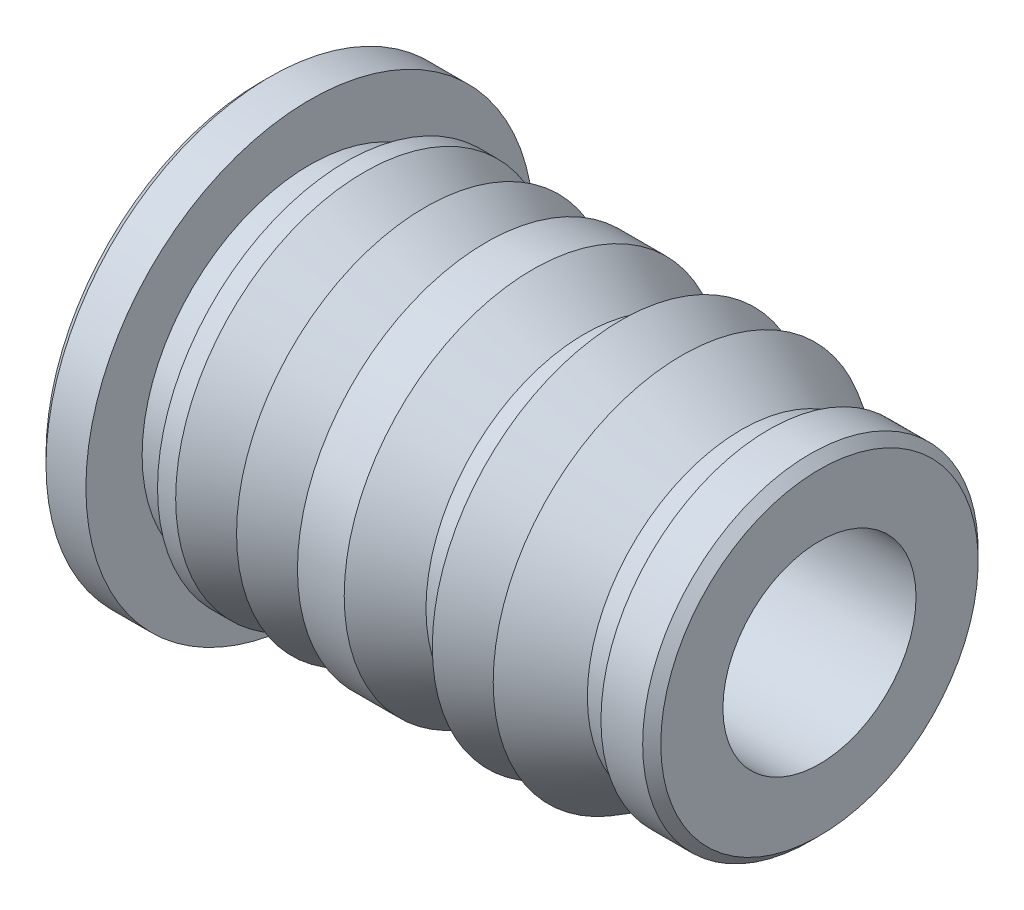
ISO-10303-21;
HEADER;
FILE_DESCRIPTION(('STEP AP214'),'2;1');
FILE_NAME('part.step','',(''),(''),'','','');
FILE_SCHEMA(('AUTOMOTIVE_DESIGN { 1 0 10303 214 1 1 1 1 }'));
ENDSEC;
DATA;
#1=APPLICATION_CONTEXT('core data for automotive mechanical design processes');
#2=APPLICATION_PROTOCOL_DEFINITION('international standard','automotive_design',2000,#1);
#3=PRODUCT_CONTEXT('',#1,'mechanical');
#4=PRODUCT('Part','Part','',(#3));
#5=PRODUCT_RELATED_PRODUCT_CATEGORY('part','',(#4));
#6=PRODUCT_DEFINITION_FORMATION('','',#4);
#7=PRODUCT_DEFINITION_CONTEXT('part definition',#1,'design');
#8=PRODUCT_DEFINITION('design','',#6,#7);
#9=PRODUCT_DEFINITION_SHAPE('','',#8);
#10=(LENGTH_UNIT() NAMED_UNIT(*) SI_UNIT(.MILLI.,.METRE.));
#11=(NAMED_UNIT(*) PLANE_ANGLE_UNIT() SI_UNIT($,.RADIAN.));
#12=(NAMED_UNIT(*) SI_UNIT($,.STERADIAN.) SOLID_ANGLE_UNIT());
#13=UNCERTAINTY_MEASURE_WITH_UNIT(LENGTH_MEASURE(1.E-05),#10,'distance_accuracy_value','');
#14=(GEOMETRIC_REPRESENTATION_CONTEXT(3) GLOBAL_UNCERTAINTY_ASSIGNED_CONTEXT((#13)) GLOBAL_UNIT_ASSIGNED_CONTEXT((#10,
#11,#12)) REPRESENTATION_CONTEXT('',''));
#15=CARTESIAN_POINT('',(0.,0.,0.));
#16=DIRECTION('',(0.,0.,1.));
#17=DIRECTION('',(1.,0.,0.));
#18=AXIS2_PLACEMENT_3D('',#15,#16,#17);
#19=CARTESIAN_POINT('',(0.,0.,0.));
#20=DIRECTION('',(-1.,0.,0.));
#21=DIRECTION('',(0.,0.,1.));
#22=AXIS2_PLACEMENT_3D('',#19,#20,#21);
#23=CONICAL_SURFACE('',#22,1.905,0.785398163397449);
#24=CARTESIAN_POINT('',(0.55245,0.,0.));
#25=DIRECTION('',(-1.,0.,0.));
#26=DIRECTION('',(0.,0.,1.));
#27=AXIS2_PLACEMENT_3D('',#24,#25,#26);
#28=CIRCLE('',#27,1.35255);
#29=CARTESIAN_POINT('',(0.55245,0.,1.35255));
#30=VERTEX_POINT('',#29);
#31=EDGE_CURVE('E11',#30,#30,#28,.T.);
#32=ORIENTED_EDGE('',*,*,#31,.F.);
#33=EDGE_LOOP('',(#32));
#34=FACE_BOUND('',#33,.T.);
#35=CARTESIAN_POINT('',(0.,0.,0.));
#36=DIRECTION('',(-1.,0.,0.));
#37=DIRECTION('',(0.,0.,1.));
#38=AXIS2_PLACEMENT_3D('',#35,#36,#37);
#39=CIRCLE('',#38,1.905);
#40=CARTESIAN_POINT('',(0.,0.,1.905));
#41=VERTEX_POINT('',#40);
#42=EDGE_CURVE('E26',#41,#41,#39,.T.);
#43=ORIENTED_EDGE('',*,*,#42,.T.);
#44=EDGE_LOOP('',(#43));
#45=FACE_BOUND('',#44,.T.);
#46=ADVANCED_FACE('F17',(#34,#45),#23,.F.);
#47=CARTESIAN_POINT('',(0.,0.,0.));
#48=DIRECTION('',(-1.,0.,0.));
#49=DIRECTION('',(0.,0.,1.));
#50=AXIS2_PLACEMENT_3D('',#47,#48,#49);
#51=CYLINDRICAL_SURFACE('',#50,1.35255);
#52=CARTESIAN_POINT('',(7.8232,0.,0.));
#53=DIRECTION('',(-1.,0.,0.));
#54=DIRECTION('',(0.,0.,1.));
#55=AXIS2_PLACEMENT_3D('',#52,#53,#54);
#56=CIRCLE('',#55,1.35255);
#57=CARTESIAN_POINT('',(7.8232,0.,1.35255));
#58=VERTEX_POINT('',#57);
#59=EDGE_CURVE('E197',#58,#58,#56,.T.);
#60=ORIENTED_EDGE('',*,*,#59,.F.);
#61=EDGE_LOOP('',(#60));
#62=FACE_BOUND('',#61,.T.);
#63=ORIENTED_EDGE('',*,*,#31,.T.);
#64=EDGE_LOOP('',(#63));
#65=FACE_BOUND('',#64,.T.);
#66=ADVANCED_FACE('F244',(#62,#65),#51,.F.);
#67=CARTESIAN_POINT('',(0.,0.,0.));
#68=DIRECTION('',(1.,0.,0.));
#69=DIRECTION('',(0.,1.,0.));
#70=AXIS2_PLACEMENT_3D('',#67,#68,#69);
#71=PLANE('',#70);
#72=ORIENTED_EDGE('',*,*,#42,.F.);
#73=EDGE_LOOP('',(#72));
#74=FACE_BOUND('',#73,.T.);
#75=CARTESIAN_POINT('',(0.,0.,0.));
#76=DIRECTION('',(-1.,0.,0.));
#77=DIRECTION('',(0.,0.,1.));
#78=AXIS2_PLACEMENT_3D('',#75,#76,#77);
#79=CIRCLE('',#78,3.0099);
#80=CARTESIAN_POINT('',(0.,0.,3.0099));
#81=VERTEX_POINT('',#80);
#82=EDGE_CURVE('E120',#81,#81,#79,.T.);
#83=ORIENTED_EDGE('',*,*,#82,.T.);
#84=EDGE_LOOP('',(#83));
#85=FACE_BOUND('',#84,.T.);
#86=ADVANCED_FACE('F121',(#74,#85),#71,.F.);
#87=CARTESIAN_POINT('',(0.127,0.,0.));
#88=DIRECTION('',(1.,0.,0.));
#89=DIRECTION('',(0.,0.,-1.));
#90=AXIS2_PLACEMENT_3D('',#87,#88,#89);
#91=CONICAL_SURFACE('',#90,3.1369,0.78539816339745);
#92=ORIENTED_EDGE('',*,*,#82,.F.);
#93=EDGE_LOOP('',(#92));
#94=FACE_BOUND('',#93,.T.);
#95=CARTESIAN_POINT('',(0.127,0.,0.));
#96=DIRECTION('',(-1.,0.,0.));
#97=DIRECTION('',(0.,0.,1.));
#98=AXIS2_PLACEMENT_3D('',#95,#96,#97);
#99=CIRCLE('',#98,3.1369);
#100=CARTESIAN_POINT('',(0.127,0.,3.1369));
#101=VERTEX_POINT('',#100);
#102=EDGE_CURVE('E124',#101,#101,#99,.T.);
#103=ORIENTED_EDGE('',*,*,#102,.T.);
#104=EDGE_LOOP('',(#103));
#105=FACE_BOUND('',#104,.T.);
#106=ADVANCED_FACE('F255',(#94,#105),#91,.T.);
#107=CARTESIAN_POINT('',(1.41129348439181E-12,0.,0.));
#108=DIRECTION('',(-1.,0.,0.));
#109=DIRECTION('',(0.,0.,1.));
#110=AXIS2_PLACEMENT_3D('',#107,#108,#109);
#111=CYLINDRICAL_SURFACE('',#110,3.1369);
#112=ORIENTED_EDGE('',*,*,#102,.F.);
#113=EDGE_LOOP('',(#112));
#114=FACE_BOUND('',#113,.T.);
#115=CARTESIAN_POINT('',(0.6858,0.,0.));
#116=DIRECTION('',(-1.,0.,0.));
#117=DIRECTION('',(0.,0.,1.));
#118=AXIS2_PLACEMENT_3D('',#115,#116,#117);
#119=CIRCLE('',#118,3.1369);
#120=CARTESIAN_POINT('',(0.6858,0.,3.1369));
#121=VERTEX_POINT('',#120);
#122=EDGE_CURVE('E130',#121,#121,#119,.T.);
#123=ORIENTED_EDGE('',*,*,#122,.T.);
#124=EDGE_LOOP('',(#123));
#125=FACE_BOUND('',#124,.T.);
#126=ADVANCED_FACE('F261',(#114,#125),#111,.T.);
#127=CARTESIAN_POINT('',(0.6858,3.1369,0.));
#128=DIRECTION('',(-1.,0.,0.));
#129=DIRECTION('',(0.,0.,1.));
#130=AXIS2_PLACEMENT_3D('',#127,#128,#129);
#131=PLANE('',#130);
#132=CARTESIAN_POINT('',(0.6858,0.,0.));
#133=DIRECTION('',(-1.,0.,0.));
#134=DIRECTION('',(0.,0.,1.));
#135=AXIS2_PLACEMENT_3D('',#132,#133,#134);
#136=CIRCLE('',#135,2.3495);
#137=CARTESIAN_POINT('',(0.6858,0.,2.3495));
#138=VERTEX_POINT('',#137);
#139=EDGE_CURVE('E135',#138,#138,#136,.T.);
#140=ORIENTED_EDGE('',*,*,#139,.T.);
#141=EDGE_LOOP('',(#140));
#142=FACE_BOUND('',#141,.T.);
#143=ORIENTED_EDGE('',*,*,#122,.F.);
#144=EDGE_LOOP('',(#143));
#145=FACE_BOUND('',#144,.T.);
#146=ADVANCED_FACE('F484',(#142,#145),#131,.F.);
#147=CARTESIAN_POINT('',(1.41129348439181E-12,0.,0.));
#148=DIRECTION('',(-1.,0.,0.));
#149=DIRECTION('',(0.,0.,1.));
#150=AXIS2_PLACEMENT_3D('',#147,#148,#149);
#151=CYLINDRICAL_SURFACE('',#150,2.3495);
#152=ORIENTED_EDGE('',*,*,#139,.F.);
#153=EDGE_LOOP('',(#152));
#154=FACE_BOUND('',#153,.T.);
#155=CARTESIAN_POINT('',(1.1938,0.,0.));
#156=DIRECTION('',(-1.,0.,0.));
#157=DIRECTION('',(0.,0.,1.));
#158=AXIS2_PLACEMENT_3D('',#155,#156,#157);
#159=CIRCLE('',#158,2.3495);
#160=CARTESIAN_POINT('',(1.1938,0.,2.3495));
#161=VERTEX_POINT('',#160);
#162=EDGE_CURVE('E139',#161,#161,#159,.T.);
#163=ORIENTED_EDGE('',*,*,#162,.T.);
#164=EDGE_LOOP('',(#163));
#165=FACE_BOUND('',#164,.T.);
#166=ADVANCED_FACE('F492',(#154,#165),#151,.T.);
#167=CARTESIAN_POINT('',(1.1938,2.3495,0.));
#168=DIRECTION('',(1.,0.,0.));
#169=DIRECTION('',(0.,1.,0.));
#170=AXIS2_PLACEMENT_3D('',#167,#168,#169);
#171=PLANE('',#170);
#172=ORIENTED_EDGE('',*,*,#162,.F.);
#173=EDGE_LOOP('',(#172));
#174=FACE_BOUND('',#173,.T.);
#175=CARTESIAN_POINT('',(1.1938,0.,0.));
#176=DIRECTION('',(-1.,0.,0.));
#177=DIRECTION('',(0.,0.,1.));
#178=AXIS2_PLACEMENT_3D('',#175,#176,#177);
#179=CIRCLE('',#178,2.6416);
#180=CARTESIAN_POINT('',(1.1938,0.,2.6416));
#181=VERTEX_POINT('',#180);
#182=EDGE_CURVE('E136',#181,#181,#179,.T.);
#183=ORIENTED_EDGE('',*,*,#182,.T.);
#184=EDGE_LOOP('',(#183));
#185=FACE_BOUND('',#184,.T.);
#186=ADVANCED_FACE('F496',(#174,#185),#171,.F.);
#187=CARTESIAN_POINT('',(1.41129348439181E-12,0.,0.));
#188=DIRECTION('',(-1.,0.,0.));
#189=DIRECTION('',(0.,0.,1.));
#190=AXIS2_PLACEMENT_3D('',#187,#188,#189);
#191=CYLINDRICAL_SURFACE('',#190,2.6416);
#192=ORIENTED_EDGE('',*,*,#182,.F.);
#193=EDGE_LOOP('',(#192));
#194=FACE_BOUND('',#193,.T.);
#195=CARTESIAN_POINT('',(1.4478,0.,0.));
#196=DIRECTION('',(-1.,0.,0.));
#197=DIRECTION('',(0.,0.,1.));
#198=AXIS2_PLACEMENT_3D('',#195,#196,#197);
#199=CIRCLE('',#198,2.6416);
#200=CARTESIAN_POINT('',(1.4478,0.,2.6416));
#201=VERTEX_POINT('',#200);
#202=EDGE_CURVE('E140',#201,#201,#199,.T.);
#203=ORIENTED_EDGE('',*,*,#202,.T.);
#204=EDGE_LOOP('',(#203));
#205=FACE_BOUND('',#204,.T.);
#206=ADVANCED_FACE('F506',(#194,#205),#191,.T.);
#207=CARTESIAN_POINT('',(2.17370249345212,0.,0.));
#208=DIRECTION('',(-1.,0.,0.));
#209=DIRECTION('',(0.,0.,1.));
#210=AXIS2_PLACEMENT_3D('',#207,#208,#209);
#211=CONICAL_SURFACE('',#210,2.2225,0.523598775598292);
#212=CARTESIAN_POINT('',(2.17370249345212,0.,0.));
#213=DIRECTION('',(-1.,0.,0.));
#214=DIRECTION('',(0.,0.,1.));
#215=AXIS2_PLACEMENT_3D('',#212,#213,#214);
#216=CIRCLE('',#215,2.2225);
#217=CARTESIAN_POINT('',(2.17370249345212,0.,2.2225));
#218=VERTEX_POINT('',#217);
#219=EDGE_CURVE('E143',#218,#218,#216,.T.);
#220=ORIENTED_EDGE('',*,*,#219,.T.);
#221=EDGE_LOOP('',(#220));
#222=FACE_BOUND('',#221,.T.);
#223=ORIENTED_EDGE('',*,*,#202,.F.);
#224=EDGE_LOOP('',(#223));
#225=FACE_BOUND('',#224,.T.);
#226=ADVANCED_FACE('F525',(#222,#225),#211,.T.);
#227=CARTESIAN_POINT('',(1.41129348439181E-12,0.,0.));
#228=DIRECTION('',(-1.,0.,0.));
#229=DIRECTION('',(0.,0.,1.));
#230=AXIS2_PLACEMENT_3D('',#227,#228,#229);
#231=CYLINDRICAL_SURFACE('',#230,2.2225);
#232=ORIENTED_EDGE('',*,*,#219,.F.);
#233=EDGE_LOOP('',(#232));
#234=FACE_BOUND('',#233,.T.);
#235=CARTESIAN_POINT('',(2.30070249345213,0.,0.));
#236=DIRECTION('',(-1.,0.,0.));
#237=DIRECTION('',(0.,0.,1.));
#238=AXIS2_PLACEMENT_3D('',#235,#236,#237);
#239=CIRCLE('',#238,2.2225);
#240=CARTESIAN_POINT('',(2.30070249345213,0.,2.2225));
#241=VERTEX_POINT('',#240);
#242=EDGE_CURVE('E144',#241,#241,#239,.T.);
#243=ORIENTED_EDGE('',*,*,#242,.T.);
#244=EDGE_LOOP('',(#243));
#245=FACE_BOUND('',#244,.T.);
#246=ADVANCED_FACE('F535',(#234,#245),#231,.T.);
#247=CARTESIAN_POINT('',(2.30070249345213,2.6416,0.));
#248=DIRECTION('',(1.,0.,0.));
#249=DIRECTION('',(0.,1.,0.));
#250=AXIS2_PLACEMENT_3D('',#247,#248,#249);
#251=PLANE('',#250);
#252=ORIENTED_EDGE('',*,*,#242,.F.);
#253=EDGE_LOOP('',(#252));
#254=FACE_BOUND('',#253,.T.);
#255=CARTESIAN_POINT('',(2.30070249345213,0.,0.));
#256=DIRECTION('',(-1.,0.,0.));
#257=DIRECTION('',(0.,0.,1.));
#258=AXIS2_PLACEMENT_3D('',#255,#256,#257);
#259=CIRCLE('',#258,2.6416);
#260=CARTESIAN_POINT('',(2.30070249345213,0.,2.6416));
#261=VERTEX_POINT('',#260);
#262=EDGE_CURVE('E147',#261,#261,#259,.T.);
#263=ORIENTED_EDGE('',*,*,#262,.T.);
#264=EDGE_LOOP('',(#263));
#265=FACE_BOUND('',#264,.T.);
#266=ADVANCED_FACE('F545',(#254,#265),#251,.F.);
#267=CARTESIAN_POINT('',(3.02660498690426,0.,0.));
#268=DIRECTION('',(-1.,0.,0.));
#269=DIRECTION('',(0.,0.,1.));
#270=AXIS2_PLACEMENT_3D('',#267,#268,#269);
#271=CONICAL_SURFACE('',#270,2.2225,0.523598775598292);
#272=CARTESIAN_POINT('',(3.02660498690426,0.,0.));
#273=DIRECTION('',(-1.,0.,0.));
#274=DIRECTION('',(0.,0.,1.));
#275=AXIS2_PLACEMENT_3D('',#272,#273,#274);
#276=CIRCLE('',#275,2.2225);
#277=CARTESIAN_POINT('',(3.02660498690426,0.,2.2225));
#278=VERTEX_POINT('',#277);
#279=EDGE_CURVE('E151',#278,#278,#276,.T.);
#280=ORIENTED_EDGE('',*,*,#279,.T.);
#281=EDGE_LOOP('',(#280));
#282=FACE_BOUND('',#281,.T.);
#283=ORIENTED_EDGE('',*,*,#262,.F.);
#284=EDGE_LOOP('',(#283));
#285=FACE_BOUND('',#284,.T.);
#286=ADVANCED_FACE('F555',(#282,#285),#271,.T.);
#287=CARTESIAN_POINT('',(1.41129348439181E-12,0.,0.));
#288=DIRECTION('',(-1.,0.,0.));
#289=DIRECTION('',(0.,0.,1.));
#290=AXIS2_PLACEMENT_3D('',#287,#288,#289);
#291=CYLINDRICAL_SURFACE('',#290,2.2225);
#292=ORIENTED_EDGE('',*,*,#279,.F.);
#293=EDGE_LOOP('',(#292));
#294=FACE_BOUND('',#293,.T.);
#295=CARTESIAN_POINT('',(3.15360498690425,0.,0.));
#296=DIRECTION('',(-1.,0.,0.));
#297=DIRECTION('',(0.,0.,1.));
#298=AXIS2_PLACEMENT_3D('',#295,#296,#297);
#299=CIRCLE('',#298,2.2225);
#300=CARTESIAN_POINT('',(3.15360498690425,0.,2.2225));
#301=VERTEX_POINT('',#300);
#302=EDGE_CURVE('E148',#301,#301,#299,.T.);
#303=ORIENTED_EDGE('',*,*,#302,.T.);
#304=EDGE_LOOP('',(#303));
#305=FACE_BOUND('',#304,.T.);
#306=ADVANCED_FACE('F565',(#294,#305),#291,.T.);
#307=CARTESIAN_POINT('',(3.15360498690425,2.6416,0.));
#308=DIRECTION('',(1.,0.,0.));
#309=DIRECTION('',(0.,1.,0.));
#310=AXIS2_PLACEMENT_3D('',#307,#308,#309);
#311=PLANE('',#310);
#312=ORIENTED_EDGE('',*,*,#302,.F.);
#313=EDGE_LOOP('',(#312));
#314=FACE_BOUND('',#313,.T.);
#315=CARTESIAN_POINT('',(3.15360498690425,0.,0.));
#316=DIRECTION('',(-1.,0.,0.));
#317=DIRECTION('',(0.,0.,1.));
#318=AXIS2_PLACEMENT_3D('',#315,#316,#317);
#319=CIRCLE('',#318,2.6416);
#320=CARTESIAN_POINT('',(3.15360498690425,0.,2.6416));
#321=VERTEX_POINT('',#320);
#322=EDGE_CURVE('E152',#321,#321,#319,.T.);
#323=ORIENTED_EDGE('',*,*,#322,.T.);
#324=EDGE_LOOP('',(#323));
#325=FACE_BOUND('',#324,.T.);
#326=ADVANCED_FACE('F270',(#314,#325),#311,.F.);
#327=CARTESIAN_POINT('',(1.41129348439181E-12,0.,0.));
#328=DIRECTION('',(-1.,0.,0.));
#329=DIRECTION('',(0.,0.,1.));
#330=AXIS2_PLACEMENT_3D('',#327,#328,#329);
#331=CYLINDRICAL_SURFACE('',#330,2.6416);
#332=ORIENTED_EDGE('',*,*,#322,.F.);
#333=EDGE_LOOP('',(#332));
#334=FACE_BOUND('',#333,.T.);
#335=CARTESIAN_POINT('',(3.808307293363,0.,0.));
#336=DIRECTION('',(-1.,0.,0.));
#337=DIRECTION('',(0.,0.,1.));
#338=AXIS2_PLACEMENT_3D('',#335,#336,#337);
#339=CIRCLE('',#338,2.6416);
#340=CARTESIAN_POINT('',(3.808307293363,0.,2.6416));
#341=VERTEX_POINT('',#340);
#342=EDGE_CURVE('E155',#341,#341,#339,.T.);
#343=ORIENTED_EDGE('',*,*,#342,.T.);
#344=EDGE_LOOP('',(#343));
#345=FACE_BOUND('',#344,.T.);
#346=ADVANCED_FACE('F266',(#334,#345),#331,.T.);
#347=CARTESIAN_POINT('',(4.53420978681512,0.,0.));
#348=DIRECTION('',(-1.,0.,0.));
#349=DIRECTION('',(0.,0.,1.));
#350=AXIS2_PLACEMENT_3D('',#347,#348,#349);
#351=CONICAL_SURFACE('',#350,2.2225,0.523598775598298);
#352=CARTESIAN_POINT('',(4.53420978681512,0.,0.));
#353=DIRECTION('',(-1.,0.,0.));
#354=DIRECTION('',(0.,0.,1.));
#355=AXIS2_PLACEMENT_3D('',#352,#353,#354);
#356=CIRCLE('',#355,2.2225);
#357=CARTESIAN_POINT('',(4.53420978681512,0.,2.2225));
#358=VERTEX_POINT('',#357);
#359=EDGE_CURVE('E160',#358,#358,#356,.T.);
#360=ORIENTED_EDGE('',*,*,#359,.T.);
#361=EDGE_LOOP('',(#360));
#362=FACE_BOUND('',#361,.T.);
#363=ORIENTED_EDGE('',*,*,#342,.F.);
#364=EDGE_LOOP('',(#363));
#365=FACE_BOUND('',#364,.T.);
#366=ADVANCED_FACE('F269',(#362,#365),#351,.T.);
#367=CARTESIAN_POINT('',(1.41129348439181E-12,0.,0.));
#368=DIRECTION('',(-1.,0.,0.));
#369=DIRECTION('',(0.,0.,1.));
#370=AXIS2_PLACEMENT_3D('',#367,#368,#369);
#371=CYLINDRICAL_SURFACE('',#370,2.2225);
#372=ORIENTED_EDGE('',*,*,#359,.F.);
#373=EDGE_LOOP('',(#372));
#374=FACE_BOUND('',#373,.T.);
#375=CARTESIAN_POINT('',(5.04220978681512,0.,0.));
#376=DIRECTION('',(-1.,0.,0.));
#377=DIRECTION('',(0.,0.,1.));
#378=AXIS2_PLACEMENT_3D('',#375,#376,#377);
#379=CIRCLE('',#378,2.2225);
#380=CARTESIAN_POINT('',(5.04220978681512,0.,2.2225));
#381=VERTEX_POINT('',#380);
#382=EDGE_CURVE('E163',#381,#381,#379,.T.);
#383=ORIENTED_EDGE('',*,*,#382,.T.);
#384=EDGE_LOOP('',(#383));
#385=FACE_BOUND('',#384,.T.);
#386=ADVANCED_FACE('F285',(#374,#385),#371,.T.);
#387=CARTESIAN_POINT('',(5.04220978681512,2.6416,0.));
#388=DIRECTION('',(1.,0.,0.));
#389=DIRECTION('',(0.,1.,0.));
#390=AXIS2_PLACEMENT_3D('',#387,#388,#389);
#391=PLANE('',#390);
#392=ORIENTED_EDGE('',*,*,#382,.F.);
#393=EDGE_LOOP('',(#392));
#394=FACE_BOUND('',#393,.T.);
#395=CARTESIAN_POINT('',(5.04220978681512,0.,0.));
#396=DIRECTION('',(-1.,0.,0.));
#397=DIRECTION('',(0.,0.,1.));
#398=AXIS2_PLACEMENT_3D('',#395,#396,#397);
#399=CIRCLE('',#398,2.6416);
#400=CARTESIAN_POINT('',(5.04220978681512,0.,2.6416));
#401=VERTEX_POINT('',#400);
#402=EDGE_CURVE('E190',#401,#401,#399,.T.);
#403=ORIENTED_EDGE('',*,*,#402,.T.);
#404=EDGE_LOOP('',(#403));
#405=FACE_BOUND('',#404,.T.);
#406=ADVANCED_FACE('F283',(#394,#405),#391,.F.);
#407=CARTESIAN_POINT('',(5.76811228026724,0.,0.));
#408=DIRECTION('',(-1.,0.,0.));
#409=DIRECTION('',(0.,0.,1.));
#410=AXIS2_PLACEMENT_3D('',#407,#408,#409);
#411=CONICAL_SURFACE('',#410,2.2225,0.523598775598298);
#412=CARTESIAN_POINT('',(5.76811228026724,0.,0.));
#413=DIRECTION('',(-1.,0.,0.));
#414=DIRECTION('',(0.,0.,1.));
#415=AXIS2_PLACEMENT_3D('',#412,#413,#414);
#416=CIRCLE('',#415,2.2225);
#417=CARTESIAN_POINT('',(5.76811228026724,0.,2.2225));
#418=VERTEX_POINT('',#417);
#419=EDGE_CURVE('E193',#418,#418,#416,.T.);
#420=ORIENTED_EDGE('',*,*,#419,.T.);
#421=EDGE_LOOP('',(#420));
#422=FACE_BOUND('',#421,.T.);
#423=ORIENTED_EDGE('',*,*,#402,.F.);
#424=EDGE_LOOP('',(#423));
#425=FACE_BOUND('',#424,.T.);
#426=ADVANCED_FACE('F214',(#422,#425),#411,.T.);
#427=CARTESIAN_POINT('',(1.41129348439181E-12,0.,0.));
#428=DIRECTION('',(-1.,0.,0.));
#429=DIRECTION('',(0.,0.,1.));
#430=AXIS2_PLACEMENT_3D('',#427,#428,#429);
#431=CYLINDRICAL_SURFACE('',#430,2.2225);
#432=ORIENTED_EDGE('',*,*,#419,.F.);
#433=EDGE_LOOP('',(#432));
#434=FACE_BOUND('',#433,.T.);
#435=CARTESIAN_POINT('',(5.89511228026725,0.,0.));
#436=DIRECTION('',(-1.,0.,0.));
#437=DIRECTION('',(0.,0.,1.));
#438=AXIS2_PLACEMENT_3D('',#435,#436,#437);
#439=CIRCLE('',#438,2.2225);
#440=CARTESIAN_POINT('',(5.89511228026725,0.,2.2225));
#441=VERTEX_POINT('',#440);
#442=EDGE_CURVE('E180',#441,#441,#439,.T.);
#443=ORIENTED_EDGE('',*,*,#442,.T.);
#444=EDGE_LOOP('',(#443));
#445=FACE_BOUND('',#444,.T.);
#446=ADVANCED_FACE('F217',(#434,#445),#431,.T.);
#447=CARTESIAN_POINT('',(5.89511228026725,2.6416,0.));
#448=DIRECTION('',(1.,0.,0.));
#449=DIRECTION('',(0.,1.,0.));
#450=AXIS2_PLACEMENT_3D('',#447,#448,#449);
#451=PLANE('',#450);
#452=ORIENTED_EDGE('',*,*,#442,.F.);
#453=EDGE_LOOP('',(#452));
#454=FACE_BOUND('',#453,.T.);
#455=CARTESIAN_POINT('',(5.89511228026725,0.,0.));
#456=DIRECTION('',(-1.,0.,0.));
#457=DIRECTION('',(0.,0.,1.));
#458=AXIS2_PLACEMENT_3D('',#455,#456,#457);
#459=CIRCLE('',#458,2.6416);
#460=CARTESIAN_POINT('',(5.89511228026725,0.,2.6416));
#461=VERTEX_POINT('',#460);
#462=EDGE_CURVE('E170',#461,#461,#459,.T.);
#463=ORIENTED_EDGE('',*,*,#462,.T.);
#464=EDGE_LOOP('',(#463));
#465=FACE_BOUND('',#464,.T.);
#466=ADVANCED_FACE('F220',(#454,#465),#451,.F.);
#467=CARTESIAN_POINT('',(6.731,0.,0.));
#468=DIRECTION('',(-1.,0.,0.));
#469=DIRECTION('',(0.,0.,1.));
#470=AXIS2_PLACEMENT_3D('',#467,#468,#469);
#471=CONICAL_SURFACE('',#470,2.159,0.523598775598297);
#472=CARTESIAN_POINT('',(6.731,0.,0.));
#473=DIRECTION('',(-1.,0.,0.));
#474=DIRECTION('',(0.,0.,1.));
#475=AXIS2_PLACEMENT_3D('',#472,#473,#474);
#476=CIRCLE('',#475,2.159);
#477=CARTESIAN_POINT('',(6.731,0.,2.159));
#478=VERTEX_POINT('',#477);
#479=EDGE_CURVE('E166',#478,#478,#476,.T.);
#480=ORIENTED_EDGE('',*,*,#479,.T.);
#481=EDGE_LOOP('',(#480));
#482=FACE_BOUND('',#481,.T.);
#483=ORIENTED_EDGE('',*,*,#462,.F.);
#484=EDGE_LOOP('',(#483));
#485=FACE_BOUND('',#484,.T.);
#486=ADVANCED_FACE('F226',(#482,#485),#471,.T.);
#487=CARTESIAN_POINT('',(1.41129348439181E-12,0.,0.));
#488=DIRECTION('',(-1.,0.,0.));
#489=DIRECTION('',(0.,0.,1.));
#490=AXIS2_PLACEMENT_3D('',#487,#488,#489);
#491=CYLINDRICAL_SURFACE('',#490,2.159);
#492=ORIENTED_EDGE('',*,*,#479,.F.);
#493=EDGE_LOOP('',(#492));
#494=FACE_BOUND('',#493,.T.);
#495=CARTESIAN_POINT('',(7.112,0.,0.));
#496=DIRECTION('',(-1.,0.,0.));
#497=DIRECTION('',(0.,0.,1.));
#498=AXIS2_PLACEMENT_3D('',#495,#496,#497);
#499=CIRCLE('',#498,2.159);
#500=CARTESIAN_POINT('',(7.112,0.,2.159));
#501=VERTEX_POINT('',#500);
#502=EDGE_CURVE('E171',#501,#501,#499,.T.);
#503=ORIENTED_EDGE('',*,*,#502,.T.);
#504=EDGE_LOOP('',(#503));
#505=FACE_BOUND('',#504,.T.);
#506=ADVANCED_FACE('F231',(#494,#505),#491,.T.);
#507=CARTESIAN_POINT('',(7.112,2.3495,0.));
#508=DIRECTION('',(1.,0.,0.));
#509=DIRECTION('',(0.,1.,0.));
#510=AXIS2_PLACEMENT_3D('',#507,#508,#509);
#511=PLANE('',#510);
#512=ORIENTED_EDGE('',*,*,#502,.F.);
#513=EDGE_LOOP('',(#512));
#514=FACE_BOUND('',#513,.T.);
#515=CARTESIAN_POINT('',(7.112,0.,0.));
#516=DIRECTION('',(-1.,0.,0.));
#517=DIRECTION('',(0.,0.,1.));
#518=AXIS2_PLACEMENT_3D('',#515,#516,#517);
#519=CIRCLE('',#518,2.3495);
#520=CARTESIAN_POINT('',(7.112,0.,2.3495));
#521=VERTEX_POINT('',#520);
#522=EDGE_CURVE('E177',#521,#521,#519,.T.);
#523=ORIENTED_EDGE('',*,*,#522,.T.);
#524=EDGE_LOOP('',(#523));
#525=FACE_BOUND('',#524,.T.);
#526=ADVANCED_FACE('F239',(#514,#525),#511,.F.);
#527=CARTESIAN_POINT('',(1.41129348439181E-12,0.,0.));
#528=DIRECTION('',(-1.,0.,0.));
#529=DIRECTION('',(0.,0.,1.));
#530=AXIS2_PLACEMENT_3D('',#527,#528,#529);
#531=CYLINDRICAL_SURFACE('',#530,2.3495);
#532=ORIENTED_EDGE('',*,*,#522,.F.);
#533=EDGE_LOOP('',(#532));
#534=FACE_BOUND('',#533,.T.);
#535=CARTESIAN_POINT('',(7.6962,0.,0.));
#536=DIRECTION('',(-1.,0.,0.));
#537=DIRECTION('',(0.,0.,1.));
#538=AXIS2_PLACEMENT_3D('',#535,#536,#537);
#539=CIRCLE('',#538,2.3495);
#540=CARTESIAN_POINT('',(7.6962,0.,2.3495));
#541=VERTEX_POINT('',#540);
#542=EDGE_CURVE('E186',#541,#541,#539,.T.);
#543=ORIENTED_EDGE('',*,*,#542,.T.);
#544=EDGE_LOOP('',(#543));
#545=FACE_BOUND('',#544,.T.);
#546=ADVANCED_FACE('F274',(#534,#545),#531,.T.);
#547=CARTESIAN_POINT('',(7.8232,0.,0.));
#548=DIRECTION('',(-1.,0.,0.));
#549=DIRECTION('',(0.,0.,1.));
#550=AXIS2_PLACEMENT_3D('',#547,#548,#549);
#551=CONICAL_SURFACE('',#550,2.2225,0.785398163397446);
#552=CARTESIAN_POINT('',(7.8232,0.,0.));
#553=DIRECTION('',(-1.,0.,0.));
#554=DIRECTION('',(0.,0.,1.));
#555=AXIS2_PLACEMENT_3D('',#552,#553,#554);
#556=CIRCLE('',#555,2.2225);
#557=CARTESIAN_POINT('',(7.8232,0.,2.2225));
#558=VERTEX_POINT('',#557);
#559=EDGE_CURVE('E201',#558,#558,#556,.T.);
#560=ORIENTED_EDGE('',*,*,#559,.T.);
#561=EDGE_LOOP('',(#560));
#562=FACE_BOUND('',#561,.T.);
#563=ORIENTED_EDGE('',*,*,#542,.F.);
#564=EDGE_LOOP('',(#563));
#565=FACE_BOUND('',#564,.T.);
#566=ADVANCED_FACE('F276',(#562,#565),#551,.T.);
#567=CARTESIAN_POINT('',(7.8232,2.2225,0.));
#568=DIRECTION('',(-1.,0.,0.));
#569=DIRECTION('',(0.,0.,1.));
#570=AXIS2_PLACEMENT_3D('',#567,#568,#569);
#571=PLANE('',#570);
#572=ORIENTED_EDGE('',*,*,#59,.T.);
#573=EDGE_LOOP('',(#572));
#574=FACE_BOUND('',#573,.T.);
#575=ORIENTED_EDGE('',*,*,#559,.F.);
#576=EDGE_LOOP('',(#575));
#577=FACE_BOUND('',#576,.T.);
#578=ADVANCED_FACE('F265',(#574,#577),#571,.F.);
#579=CLOSED_SHELL('',(#46,#66,#86,#106,#126,#146,#166,#186,#206,#226,#246,#266,#286,#306,#326,
#346,#366,#386,#406,#426,#446,#466,#486,#506,#526,#546,#566,#578));
#580=MANIFOLD_SOLID_BREP('B1',#579);
#581=ADVANCED_BREP_SHAPE_REPRESENTATION('',(#18,#580),#14);
#582=SHAPE_DEFINITION_REPRESENTATION(#9,#581);
ENDSEC;
END-ISO-10303-21;
